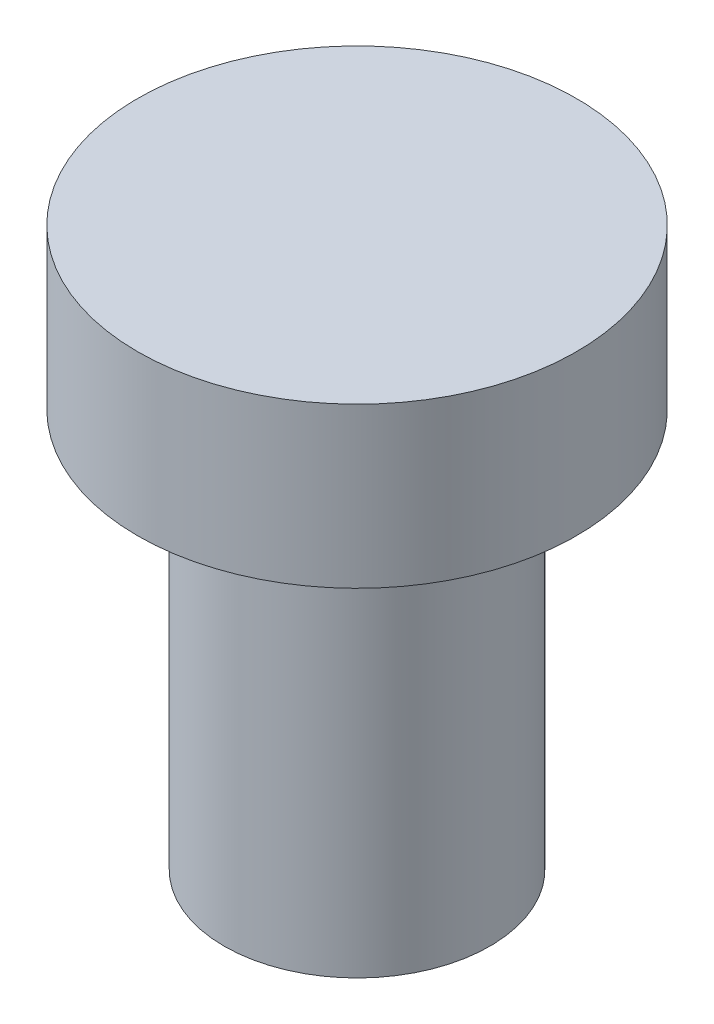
from build123d import *

# Parameters (mm, degrees)
SKETCH1_R      = 5
EXTRUDE1_DEPTH = 15
SKETCH2_R      = 8.255444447
EXTRUDE2_DEPTH = 6


with BuildPart() as part:
    # Sketch1 → Extrude1 (new body)
    with BuildSketch(Plane(origin=(0, 0, 0), x_dir=(1, 0, 0), z_dir=(0, 1, 0))):
        with Locations(Location((0, 0, 0), (0, 0, 270))):
            Circle(SKETCH1_R)
    extrude(amount=EXTRUDE1_DEPTH)

    # Sketch2 → Extrude2 (add)
    with BuildSketch(Plane(origin=(0, 15, 0), x_dir=(-1, 0, 0), z_dir=(0, 1, 0))):
        with Locations(Location((0, 0, 0), (0, 0, 90))):
            Circle(SKETCH2_R)
    extrude(amount=EXTRUDE2_DEPTH)


solid = part.part
